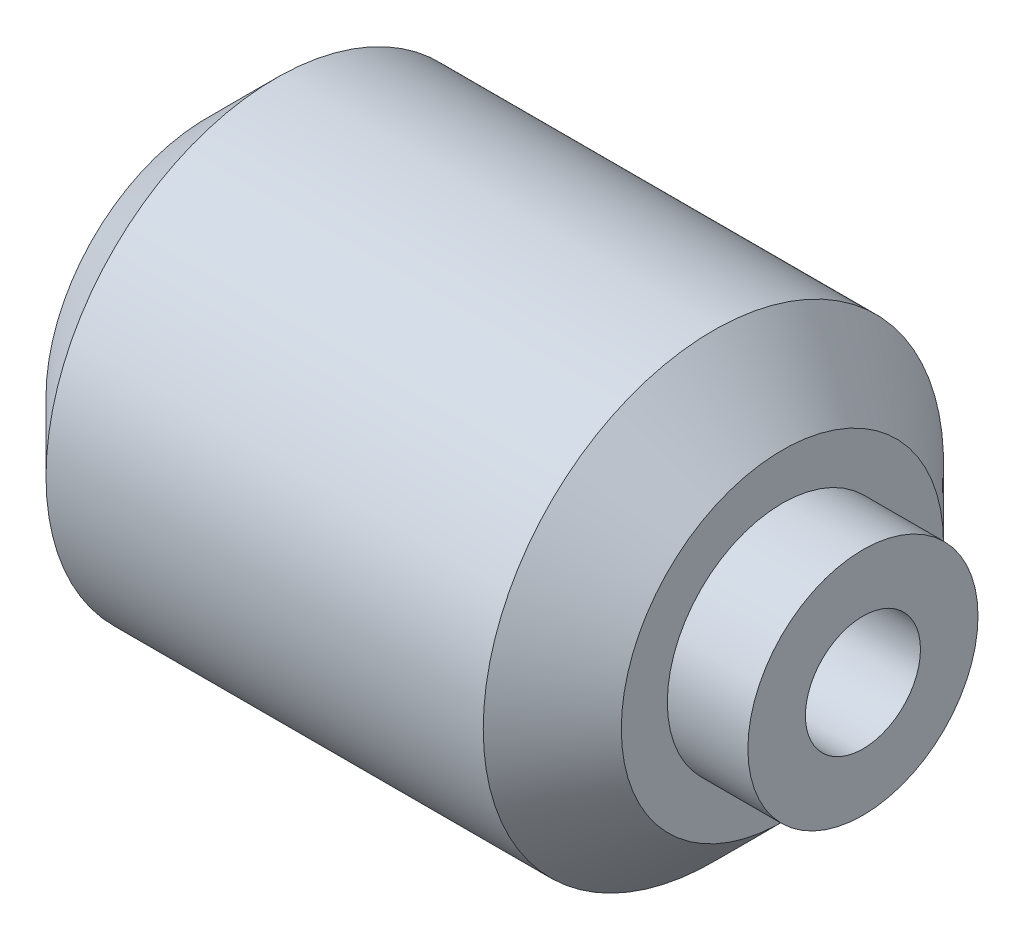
from build123d import *

# Parameters (mm, degrees)
SKETCH2_R          = 2.5
CUT_EXTRUDE1_DEPTH = 32.81587654


with BuildPart() as part:
    # Sketch1 → Revolve1 (revolve)
    with BuildSketch(Plane(origin=(0, 0, 0), x_dir=(1, 0, 0), z_dir=(0, 1, 0)), mode=Mode.PRIVATE) as revolve1_sk:
        Polygon((0, 0), (28.5, 0), (28.5, 5), (25, 5), (25, 7), (22, 10), (3, 10), (0, 7), align=None)
    revolve(revolve1_sk.sketch.rotate(Axis((0, 0, 0), (1, 0, 0)), 180), axis=Axis((0, 0, 0), (1, 0, 0)))

    # Sketch2 → Cut-Extrude1 (cut, through all)
    with BuildSketch(Plane(origin=(28.5, 0, 0), x_dir=(0, 0, -1), z_dir=(1, 0, 0))):
        Circle(SKETCH2_R)
    extrude(amount=-CUT_EXTRUDE1_DEPTH, mode=Mode.SUBTRACT)


solid = part.part
